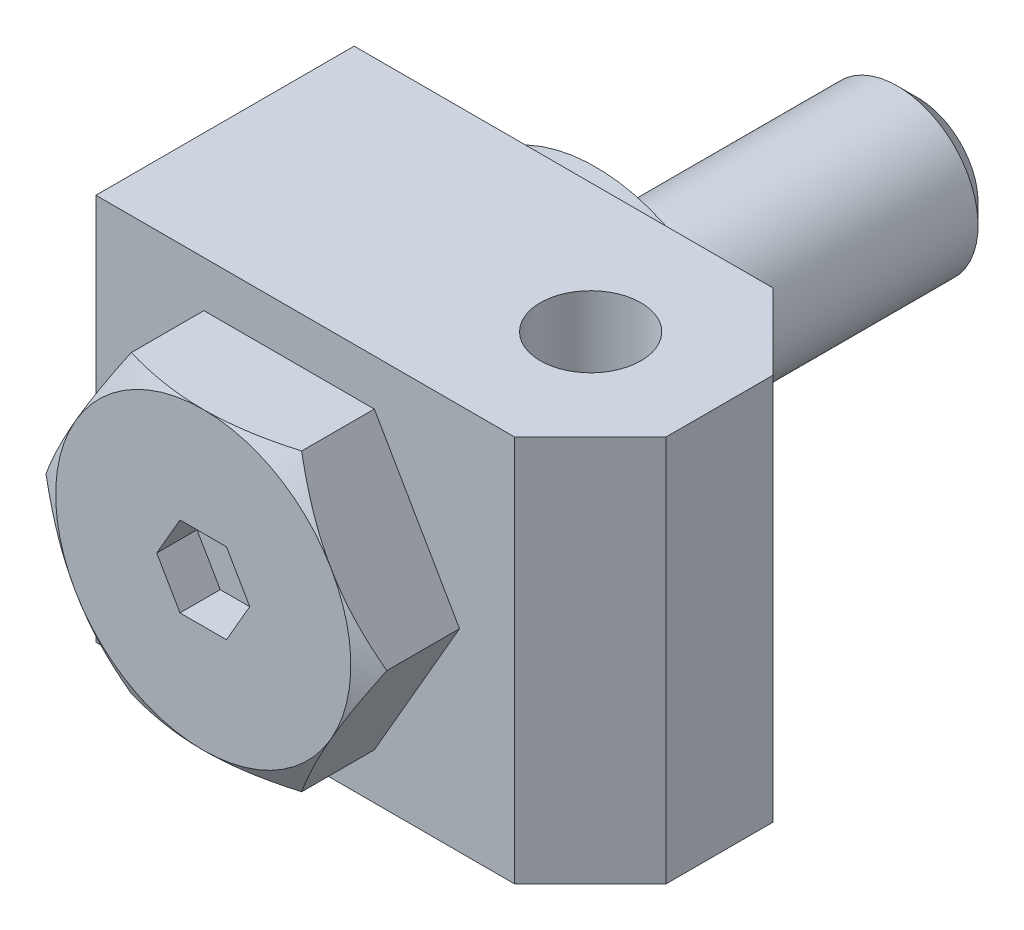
ISO-10303-21;
HEADER;
FILE_DESCRIPTION(('STEP AP214'),'2;1');
FILE_NAME('part.step','',(''),(''),'','','');
FILE_SCHEMA(('AUTOMOTIVE_DESIGN { 1 0 10303 214 1 1 1 1 }'));
ENDSEC;
DATA;
#1=APPLICATION_CONTEXT('core data for automotive mechanical design processes');
#2=APPLICATION_PROTOCOL_DEFINITION('international standard','automotive_design',2000,#1);
#3=PRODUCT_CONTEXT('',#1,'mechanical');
#4=PRODUCT('Part','Part','',(#3));
#5=PRODUCT_RELATED_PRODUCT_CATEGORY('part','',(#4));
#6=PRODUCT_DEFINITION_FORMATION('','',#4);
#7=PRODUCT_DEFINITION_CONTEXT('part definition',#1,'design');
#8=PRODUCT_DEFINITION('design','',#6,#7);
#9=PRODUCT_DEFINITION_SHAPE('','',#8);
#10=(LENGTH_UNIT() NAMED_UNIT(*) SI_UNIT(.MILLI.,.METRE.));
#11=(NAMED_UNIT(*) PLANE_ANGLE_UNIT() SI_UNIT($,.RADIAN.));
#12=(NAMED_UNIT(*) SI_UNIT($,.STERADIAN.) SOLID_ANGLE_UNIT());
#13=UNCERTAINTY_MEASURE_WITH_UNIT(LENGTH_MEASURE(1.E-05),#10,'distance_accuracy_value','');
#14=(GEOMETRIC_REPRESENTATION_CONTEXT(3) GLOBAL_UNCERTAINTY_ASSIGNED_CONTEXT((#13)) GLOBAL_UNIT_ASSIGNED_CONTEXT((#10,
#11,#12)) REPRESENTATION_CONTEXT('',''));
#15=CARTESIAN_POINT('',(0.,0.,0.));
#16=DIRECTION('',(0.,0.,1.));
#17=DIRECTION('',(1.,0.,0.));
#18=AXIS2_PLACEMENT_3D('',#15,#16,#17);
#19=CARTESIAN_POINT('',(0.,0.,-48.4));
#20=DIRECTION('',(0.,0.,1.));
#21=DIRECTION('',(0.,-1.,0.));
#22=AXIS2_PLACEMENT_3D('',#19,#20,#21);
#23=CYLINDRICAL_SURFACE('',#22,12.);
#24=CARTESIAN_POINT('',(0.,0.,-45.));
#25=DIRECTION('',(0.,0.,-1.));
#26=DIRECTION('',(-1.,0.,0.));
#27=AXIS2_PLACEMENT_3D('',#24,#25,#26);
#28=CIRCLE('',#27,12.);
#29=CARTESIAN_POINT('',(-12.,0.,-45.));
#30=VERTEX_POINT('',#29);
#31=EDGE_CURVE('E9',#30,#30,#28,.F.);
#32=ORIENTED_EDGE('',*,*,#31,.T.);
#33=EDGE_LOOP('',(#32));
#34=FACE_BOUND('',#33,.T.);
#35=CARTESIAN_POINT('',(0.,0.,0.));
#36=DIRECTION('',(0.,0.,1.));
#37=DIRECTION('',(0.,-1.,0.));
#38=AXIS2_PLACEMENT_3D('',#35,#36,#37);
#39=CIRCLE('',#38,12.);
#40=CARTESIAN_POINT('',(0.,-12.,0.));
#41=VERTEX_POINT('',#40);
#42=EDGE_CURVE('E374',#41,#41,#39,.F.);
#43=ORIENTED_EDGE('',*,*,#42,.T.);
#44=EDGE_LOOP('',(#43));
#45=FACE_BOUND('',#44,.T.);
#46=ADVANCED_FACE('F14',(#34,#45),#23,.T.);
#47=CARTESIAN_POINT('',(25.4034118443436,0.,-33.0334193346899));
#48=DIRECTION('',(0.866025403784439,0.5,0.));
#49=DIRECTION('',(-0.5,0.866025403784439,0.));
#50=AXIS2_PLACEMENT_3D('',#47,#48,#49);
#51=PLANE('',#50);
#52=DIRECTION('',(0.,0.,1.));
#53=VECTOR('',#52,1.);
#54=CARTESIAN_POINT('',(12.7017059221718,22.,-33.0334193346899));
#55=LINE('',#54,#53);
#56=CARTESIAN_POINT('',(12.7017059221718,22.,45.7));
#57=VERTEX_POINT('',#56);
#58=CARTESIAN_POINT('',(12.7017059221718,22.,56.5350392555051));
#59=VERTEX_POINT('',#58);
#60=EDGE_CURVE('E303',#57,#59,#55,.T.);
#61=ORIENTED_EDGE('',*,*,#60,.T.);
#62=CARTESIAN_POINT('',(12.7015904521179,22.0002,56.5349725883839));
#63=CARTESIAN_POINT('',(12.9807685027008,21.5166494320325,56.6961445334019));
#64=CARTESIAN_POINT('',(13.2610354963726,21.0312127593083,56.8500027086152));
#65=CARTESIAN_POINT('',(13.8238168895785,20.0564467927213,57.141058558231));
#66=CARTESIAN_POINT('',(14.106331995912,19.567116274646,57.2782507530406));
#67=CARTESIAN_POINT('',(14.674161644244,18.583606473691,57.5341332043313));
#68=CARTESIAN_POINT('',(14.9594812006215,18.0894185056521,57.6527792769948));
#69=CARTESIAN_POINT('',(15.5320907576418,17.0976296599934,57.8690135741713));
#70=CARTESIAN_POINT('',(15.8193805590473,16.6000291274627,57.9666038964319));
#71=CARTESIAN_POINT('',(16.3885872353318,15.6141342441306,58.1365841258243));
#72=CARTESIAN_POINT('',(16.6704618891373,15.1259130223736,58.2095361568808));
#73=CARTESIAN_POINT('',(17.2355027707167,14.1472335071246,58.3318601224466));
#74=CARTESIAN_POINT('',(17.518669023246,13.6567751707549,58.3812316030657));
#75=CARTESIAN_POINT('',(18.085477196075,12.6750346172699,58.455147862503));
#76=CARTESIAN_POINT('',(18.3691181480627,12.1837540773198,58.4797221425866));
#77=CARTESIAN_POINT('',(18.9366618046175,11.2007396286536,58.5035155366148));
#78=CARTESIAN_POINT('',(19.2205645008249,10.7090057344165,58.5027354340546));
#79=CARTESIAN_POINT('',(19.7513256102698,9.78970052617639,58.4775909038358));
#80=CARTESIAN_POINT('',(19.9982218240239,9.36206373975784,58.4562926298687));
#81=CARTESIAN_POINT('',(20.491424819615,8.50781109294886,58.3949248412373));
#82=CARTESIAN_POINT('',(20.7377316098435,8.08119521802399,58.3548555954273));
#83=CARTESIAN_POINT('',(21.2296647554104,7.2291420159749,58.2566403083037));
#84=CARTESIAN_POINT('',(21.4752902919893,6.80370610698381,58.1984779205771));
#85=CARTESIAN_POINT('',(21.9653652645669,5.95487135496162,58.0651057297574));
#86=CARTESIAN_POINT('',(22.2098147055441,5.53147250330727,57.9898959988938));
#87=CARTESIAN_POINT('',(22.9519111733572,4.24612371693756,57.7367656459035));
#88=CARTESIAN_POINT('',(23.4474497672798,3.38782569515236,57.5335912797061));
#89=CARTESIAN_POINT('',(24.1852851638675,2.10985730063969,57.1876964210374));
#90=CARTESIAN_POINT('',(24.4301067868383,1.6858138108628,57.0656670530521));
#91=CARTESIAN_POINT('',(24.9180566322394,0.840659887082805,56.8092543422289));
#92=CARTESIAN_POINT('',(25.1611853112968,0.419548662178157,56.6748744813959));
#93=CARTESIAN_POINT('',(25.4035273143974,-0.000200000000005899,56.5349725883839));
#94=B_SPLINE_CURVE_WITH_KNOTS('',3,(#62,#63,#64,#65,#66,#67,#68,#69,#70,#71,#72,#73,#74,#75,#76,
#77,#78,#79,#80,#81,#82,#83,#84,#85,#86,#87,#88,#89,#90,#91,#92,#93),.UNSPECIFIED.,.F.,.F.,(4,2,
2,2,2,2,2,2,2,2,2,2,2,2,2,4),(0.,1.74350234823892,3.48757639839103,5.23574415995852,
6.98373767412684,8.68862327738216,10.393541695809,12.096429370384,13.7992644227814,
15.2816610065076,16.7640363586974,18.2477548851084,19.7314671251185,22.7642468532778,
24.2779950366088,25.7913177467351),.UNSPECIFIED.);
#95=CARTESIAN_POINT('',(19.0525588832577,11.,58.5));
#96=VERTEX_POINT('',#95);
#97=EDGE_CURVE('E304',#59,#96,#94,.T.);
#98=ORIENTED_EDGE('',*,*,#97,.T.);
#99=CARTESIAN_POINT('',(25.4034118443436,0.,56.5350392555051));
#100=VERTEX_POINT('',#99);
#101=EDGE_CURVE('E37',#96,#100,#94,.T.);
#102=ORIENTED_EDGE('',*,*,#101,.T.);
#103=DIRECTION('',(0.,0.,1.));
#104=VECTOR('',#103,1.);
#105=CARTESIAN_POINT('',(25.4034118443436,0.,-33.0334193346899));
#106=LINE('',#105,#104);
#107=CARTESIAN_POINT('',(25.4034118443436,0.,45.7));
#108=VERTEX_POINT('',#107);
#109=EDGE_CURVE('E310',#108,#100,#106,.T.);
#110=ORIENTED_EDGE('',*,*,#109,.F.);
#111=DIRECTION('',(0.5,-0.866025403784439,0.));
#112=VECTOR('',#111,1.);
#113=CARTESIAN_POINT('',(25.4034118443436,0.,45.7));
#114=LINE('',#113,#112);
#115=EDGE_CURVE('E307',#57,#108,#114,.T.);
#116=ORIENTED_EDGE('',*,*,#115,.F.);
#117=EDGE_LOOP('',(#61,#98,#102,#110,#116));
#118=FACE_BOUND('',#117,.T.);
#119=ADVANCED_FACE('F288',(#118),#51,.T.);
#120=CARTESIAN_POINT('',(12.7017059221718,22.,-33.0334193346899));
#121=DIRECTION('',(0.,1.,0.));
#122=DIRECTION('',(-1.,0.,0.));
#123=AXIS2_PLACEMENT_3D('',#120,#121,#122);
#124=PLANE('',#123);
#125=DIRECTION('',(0.,0.,1.));
#126=VECTOR('',#125,1.);
#127=CARTESIAN_POINT('',(-12.7017059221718,22.,-33.0334193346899));
#128=LINE('',#127,#126);
#129=CARTESIAN_POINT('',(-12.7017059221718,22.,45.7));
#130=VERTEX_POINT('',#129);
#131=CARTESIAN_POINT('',(-12.7017059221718,22.,56.5350392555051));
#132=VERTEX_POINT('',#131);
#133=EDGE_CURVE('E309',#130,#132,#128,.T.);
#134=ORIENTED_EDGE('',*,*,#133,.T.);
#135=CARTESIAN_POINT('',(-34.083023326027,22.,47.780543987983));
#136=CARTESIAN_POINT('',(-33.6027553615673,22.,48.013505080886));
#137=CARTESIAN_POINT('',(-33.1219228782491,22.,48.2453018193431));
#138=CARTESIAN_POINT('',(-32.1590110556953,22.,48.7063028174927));
#139=CARTESIAN_POINT('',(-31.676931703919,22.,48.9355070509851));
#140=CARTESIAN_POINT('',(-30.2285177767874,22.,49.618895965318));
#141=CARTESIAN_POINT('',(-29.2601499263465,22.,50.0687875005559));
#142=CARTESIAN_POINT('',(-27.3116352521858,22.,50.9568248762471));
#143=CARTESIAN_POINT('',(-26.3314529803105,22.,51.3948931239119));
#144=CARTESIAN_POINT('',(-24.3632812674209,22.,52.2530628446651));
#145=CARTESIAN_POINT('',(-23.3752921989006,22.,52.6731651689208));
#146=CARTESIAN_POINT('',(-21.3581422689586,22.,53.5037387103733));
#147=CARTESIAN_POINT('',(-20.3286757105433,22.,53.913471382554));
#148=CARTESIAN_POINT('',(-18.2576780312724,22.,54.7018424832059));
#149=CARTESIAN_POINT('',(-17.2161455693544,22.,55.0804774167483));
#150=CARTESIAN_POINT('',(-15.1213542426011,22.,55.796681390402));
#151=CARTESIAN_POINT('',(-14.0681241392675,22.,56.1343338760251));
#152=CARTESIAN_POINT('',(-11.9464557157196,22.,56.757733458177));
#153=CARTESIAN_POINT('',(-10.87802231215,22.,57.0434969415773));
#154=CARTESIAN_POINT('',(-9.26674898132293,22.,57.4220842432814));
#155=CARTESIAN_POINT('',(-8.72969490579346,22.,57.5396841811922));
#156=CARTESIAN_POINT('',(-7.65192372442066,22.,57.7567947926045));
#157=CARTESIAN_POINT('',(-7.11120669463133,22.,57.8563058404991));
#158=CARTESIAN_POINT('',(-6.02649470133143,22.,58.0354783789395));
#159=CARTESIAN_POINT('',(-5.48249984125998,22.,58.1151404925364));
#160=CARTESIAN_POINT('',(-4.39178136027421,22.,58.2530296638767));
#161=CARTESIAN_POINT('',(-3.84505774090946,22.,58.3112567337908));
#162=CARTESIAN_POINT('',(-2.75679839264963,22.,58.404385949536));
#163=CARTESIAN_POINT('',(-2.21528800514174,22.,58.4395824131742));
#164=CARTESIAN_POINT('',(-1.13126532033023,22.,58.4870464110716));
#165=CARTESIAN_POINT('',(-0.58875303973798,22.,58.4993143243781));
#166=CARTESIAN_POINT('',(0.496305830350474,22.,58.5006296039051));
#167=CARTESIAN_POINT('',(1.03885242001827,22.,58.4896768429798));
#168=CARTESIAN_POINT('',(2.1230014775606,22.,58.4448172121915));
#169=CARTESIAN_POINT('',(2.66460390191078,22.,58.4109093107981));
#170=CARTESIAN_POINT('',(3.96733752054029,22.,58.3024590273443));
#171=CARTESIAN_POINT('',(4.72757291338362,22.,58.2169644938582));
#172=CARTESIAN_POINT('',(6.24238249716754,22.,58.0054114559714));
#173=CARTESIAN_POINT('',(6.99695589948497,22.,57.8793474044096));
#174=CARTESIAN_POINT('',(8.49972953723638,22.,57.5911399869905));
#175=CARTESIAN_POINT('',(9.24792429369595,22.,57.4289683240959));
#176=CARTESIAN_POINT('',(10.7367989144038,22.,57.0734927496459));
#177=CARTESIAN_POINT('',(11.4774788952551,22.,56.8801893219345));
#178=CARTESIAN_POINT('',(12.9675415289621,22.,56.4626030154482));
#179=CARTESIAN_POINT('',(13.7167586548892,22.,56.2377335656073));
#180=CARTESIAN_POINT('',(15.2078120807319,22.,55.7648515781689));
#181=CARTESIAN_POINT('',(15.9496483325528,22.,55.5168388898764));
#182=CARTESIAN_POINT('',(17.4263077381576,22.,55.001600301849));
#183=CARTESIAN_POINT('',(18.1611331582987,22.,54.7343808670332));
#184=CARTESIAN_POINT('',(19.6247016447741,22.,54.1838635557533));
#185=CARTESIAN_POINT('',(20.3534447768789,22.,53.9005658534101));
#186=CARTESIAN_POINT('',(22.0503976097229,22.,53.2227558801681));
#187=CARTESIAN_POINT('',(23.0164915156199,22.,52.8229550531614));
#188=CARTESIAN_POINT('',(24.9406295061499,22.,52.0043763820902));
#189=CARTESIAN_POINT('',(25.898673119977,22.,51.5855974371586));
#190=CARTESIAN_POINT('',(27.8081777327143,22.,50.7327971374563));
#191=CARTESIAN_POINT('',(28.7596372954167,22.,50.2987725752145));
#192=CARTESIAN_POINT('',(30.6568492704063,22.,49.4185022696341));
#193=CARTESIAN_POINT('',(31.6026017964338,22.,48.9722567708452));
#194=CARTESIAN_POINT('',(33.4903215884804,22.,48.0693184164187));
#195=CARTESIAN_POINT('',(34.4322838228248,22.,47.6126150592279));
#196=CARTESIAN_POINT('',(36.312171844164,22.,46.6909769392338));
#197=CARTESIAN_POINT('',(37.2500976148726,22.,46.2260421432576));
#198=CARTESIAN_POINT('',(39.1224115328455,22.,45.2893876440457));
#199=CARTESIAN_POINT('',(40.0568000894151,22.,44.8176687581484));
#200=CARTESIAN_POINT('',(41.9226508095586,22.,43.8684883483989));
#201=CARTESIAN_POINT('',(42.8541129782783,22.,43.3910268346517));
#202=CARTESIAN_POINT('',(45.4923194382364,22.,42.0300239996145));
#203=CARTESIAN_POINT('',(47.1961043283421,22.,41.1407460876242));
#204=CARTESIAN_POINT('',(50.5972932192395,22.,39.3499621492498));
#205=CARTESIAN_POINT('',(52.2946970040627,22.,38.4484557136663));
#206=CARTESIAN_POINT('',(55.6803949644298,22.,36.6382408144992));
#207=CARTESIAN_POINT('',(57.3687012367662,22.,35.7295549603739));
#208=CARTESIAN_POINT('',(59.8981387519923,22.,34.3610543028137));
#209=CARTESIAN_POINT('',(60.74075895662,22.,33.9039874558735));
#210=CARTESIAN_POINT('',(62.425104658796,22.,32.9882111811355));
#211=CARTESIAN_POINT('',(63.2668301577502,22.,32.5295017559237));
#212=CARTESIAN_POINT('',(64.1081585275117,22.,32.0700648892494));
#213=B_SPLINE_CURVE_WITH_KNOTS('',3,(#135,#136,#137,#138,#139,#140,#141,#142,#143,#144,#145,
#146,#147,#148,#149,#150,#151,#152,#153,#154,#155,#156,#157,#158,#159,#160,#161,#162,#163,#164,
#165,#166,#167,#168,#169,#170,#171,#172,#173,#174,#175,#176,#177,#178,#179,#180,#181,#182,#183,
#184,#185,#186,#187,#188,#189,#190,#191,#192,#193,#194,#195,#196,#197,#198,#199,#200,#201,#202,
#203,#204,#205,#206,#207,#208,#209,#210,#211,#212),.UNSPECIFIED.,.F.,.F.,(4,2,2,2,2,2,2,2,2,2,2,
2,2,2,2,2,2,2,2,2,2,2,2,2,2,2,2,2,2,2,2,2,2,2,2,2,2,2,4),(0.,1.60135703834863,3.20273024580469,
6.40595234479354,9.62667351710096,12.847241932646,16.1708830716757,19.4948972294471,
22.8120255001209,26.1281043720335,27.7771856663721,29.4262328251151,31.0752282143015,
32.7242226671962,34.351709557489,35.979169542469,37.6066384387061,39.2341804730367,
41.5279930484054,43.8221193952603,46.1180499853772,48.4139448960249,50.7602047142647,
53.1064798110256,55.4519688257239,57.7974324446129,60.9338145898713,64.070378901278,
67.2076071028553,70.3447725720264,73.4852399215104,76.6257199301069,79.7658246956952,
82.9059239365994,88.6715478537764,94.4373651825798,100.189278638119,103.065085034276,
105.940886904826),.UNSPECIFIED.);
#214=CARTESIAN_POINT('',(0.,22.,58.5));
#215=VERTEX_POINT('',#214);
#216=EDGE_CURVE('E276',#132,#215,#213,.T.);
#217=ORIENTED_EDGE('',*,*,#216,.T.);
#218=EDGE_CURVE('E269',#215,#59,#213,.T.);
#219=ORIENTED_EDGE('',*,*,#218,.T.);
#220=ORIENTED_EDGE('',*,*,#60,.F.);
#221=DIRECTION('',(1.,0.,0.));
#222=VECTOR('',#221,1.);
#223=CARTESIAN_POINT('',(12.7017059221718,22.,45.7));
#224=LINE('',#223,#222);
#225=EDGE_CURVE('E326',#130,#57,#224,.T.);
#226=ORIENTED_EDGE('',*,*,#225,.F.);
#227=EDGE_LOOP('',(#134,#217,#219,#220,#226));
#228=FACE_BOUND('',#227,.T.);
#229=ADVANCED_FACE('F284',(#228),#124,.T.);
#230=CARTESIAN_POINT('',(-12.7017059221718,22.,-33.0334193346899));
#231=DIRECTION('',(-0.866025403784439,0.5,0.));
#232=DIRECTION('',(-0.5,-0.866025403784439,0.));
#233=AXIS2_PLACEMENT_3D('',#230,#231,#232);
#234=PLANE('',#233);
#235=DIRECTION('',(0.,0.,1.));
#236=VECTOR('',#235,1.);
#237=CARTESIAN_POINT('',(-25.4034118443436,0.,-33.0334193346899));
#238=LINE('',#237,#236);
#239=CARTESIAN_POINT('',(-25.4034118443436,0.,45.7));
#240=VERTEX_POINT('',#239);
#241=CARTESIAN_POINT('',(-25.4034118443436,0.,56.5350392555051));
#242=VERTEX_POINT('',#241);
#243=EDGE_CURVE('E313',#240,#242,#238,.T.);
#244=ORIENTED_EDGE('',*,*,#243,.T.);
#245=CARTESIAN_POINT('',(-25.4035273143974,-0.0002,56.5349725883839));
#246=CARTESIAN_POINT('',(-25.1243492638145,0.483350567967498,56.6961445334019));
#247=CARTESIAN_POINT('',(-24.8440822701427,0.968787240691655,56.8500027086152));
#248=CARTESIAN_POINT('',(-24.2813008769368,1.94355320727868,57.141058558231));
#249=CARTESIAN_POINT('',(-23.9987857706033,2.43288372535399,57.2782507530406));
#250=CARTESIAN_POINT('',(-23.4309561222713,3.41639352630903,57.5341332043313));
#251=CARTESIAN_POINT('',(-23.1456365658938,3.9105814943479,57.6527792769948));
#252=CARTESIAN_POINT('',(-22.5730270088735,4.90237034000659,57.8690135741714));
#253=CARTESIAN_POINT('',(-22.285737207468,5.39997087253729,57.9666038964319));
#254=CARTESIAN_POINT('',(-21.7165305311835,6.38586575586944,58.1365841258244));
#255=CARTESIAN_POINT('',(-21.434655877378,6.87408697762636,58.2095361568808));
#256=CARTESIAN_POINT('',(-20.8696149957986,7.85276649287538,58.3318601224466));
#257=CARTESIAN_POINT('',(-20.5864487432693,8.34322482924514,58.3812316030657));
#258=CARTESIAN_POINT('',(-20.0196405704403,9.32496538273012,58.455147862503));
#259=CARTESIAN_POINT('',(-19.7359996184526,9.81624592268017,58.4797221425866));
#260=CARTESIAN_POINT('',(-19.1684559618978,10.7992603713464,58.5035155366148));
#261=CARTESIAN_POINT('',(-18.8845532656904,11.2909942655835,58.5027354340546));
#262=CARTESIAN_POINT('',(-18.3537921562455,12.2102994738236,58.4775909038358));
#263=CARTESIAN_POINT('',(-18.1068959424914,12.6379362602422,58.4562926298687));
#264=CARTESIAN_POINT('',(-17.6136929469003,13.4921889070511,58.3949248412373));
#265=CARTESIAN_POINT('',(-17.3673861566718,13.918804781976,58.3548555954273));
#266=CARTESIAN_POINT('',(-16.8754530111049,14.7708579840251,58.2566403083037));
#267=CARTESIAN_POINT('',(-16.629827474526,15.1962938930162,58.1984779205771));
#268=CARTESIAN_POINT('',(-16.1397525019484,16.0451286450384,58.0651057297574));
#269=CARTESIAN_POINT('',(-15.8953030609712,16.4685274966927,57.9898959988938));
#270=CARTESIAN_POINT('',(-15.1532065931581,17.7538762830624,57.7367656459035));
#271=CARTESIAN_POINT('',(-14.6576679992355,18.6121743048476,57.5335912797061));
#272=CARTESIAN_POINT('',(-13.9198326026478,19.8901426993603,57.1876964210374));
#273=CARTESIAN_POINT('',(-13.675010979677,20.3141861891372,57.0656670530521));
#274=CARTESIAN_POINT('',(-13.1870611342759,21.1593401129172,56.8092543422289));
#275=CARTESIAN_POINT('',(-12.9439324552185,21.5804513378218,56.6748744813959));
#276=CARTESIAN_POINT('',(-12.7015904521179,22.0002,56.5349725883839));
#277=B_SPLINE_CURVE_WITH_KNOTS('',3,(#245,#246,#247,#248,#249,#250,#251,#252,#253,#254,#255,
#256,#257,#258,#259,#260,#261,#262,#263,#264,#265,#266,#267,#268,#269,#270,#271,#272,#273,#274,
#275,#276),.UNSPECIFIED.,.F.,.F.,(4,2,2,2,2,2,2,2,2,2,2,2,2,2,2,4),(0.,1.74350234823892,
3.48757639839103,5.23574415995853,6.98373767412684,8.68862327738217,10.393541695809,
12.0964293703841,13.7992644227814,15.2816610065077,16.7640363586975,18.2477548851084,
19.7314671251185,22.7642468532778,24.2779950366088,25.7913177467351),.UNSPECIFIED.);
#278=CARTESIAN_POINT('',(-19.0525588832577,11.,58.5));
#279=VERTEX_POINT('',#278);
#280=EDGE_CURVE('E316',#242,#279,#277,.T.);
#281=ORIENTED_EDGE('',*,*,#280,.T.);
#282=EDGE_CURVE('E277',#279,#132,#277,.T.);
#283=ORIENTED_EDGE('',*,*,#282,.T.);
#284=ORIENTED_EDGE('',*,*,#133,.F.);
#285=DIRECTION('',(0.5,0.866025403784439,0.));
#286=VECTOR('',#285,1.);
#287=CARTESIAN_POINT('',(-12.7017059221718,22.,45.7));
#288=LINE('',#287,#286);
#289=EDGE_CURVE('E411',#240,#130,#288,.T.);
#290=ORIENTED_EDGE('',*,*,#289,.F.);
#291=EDGE_LOOP('',(#244,#281,#283,#284,#290));
#292=FACE_BOUND('',#291,.T.);
#293=ADVANCED_FACE('F287',(#292),#234,.T.);
#294=CARTESIAN_POINT('',(-25.4034118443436,0.,-33.0334193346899));
#295=DIRECTION('',(-0.866025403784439,-0.5,0.));
#296=DIRECTION('',(0.5,-0.866025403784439,0.));
#297=AXIS2_PLACEMENT_3D('',#294,#295,#296);
#298=PLANE('',#297);
#299=DIRECTION('',(0.,0.,1.));
#300=VECTOR('',#299,1.);
#301=CARTESIAN_POINT('',(-12.7017059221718,-22.,-33.0334193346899));
#302=LINE('',#301,#300);
#303=CARTESIAN_POINT('',(-12.7017059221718,-22.,45.7));
#304=VERTEX_POINT('',#303);
#305=CARTESIAN_POINT('',(-12.7017059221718,-22.,56.5350392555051));
#306=VERTEX_POINT('',#305);
#307=EDGE_CURVE('E414',#304,#306,#302,.T.);
#308=ORIENTED_EDGE('',*,*,#307,.T.);
#309=CARTESIAN_POINT('',(-12.7015904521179,-22.0002,56.5349725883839));
#310=CARTESIAN_POINT('',(-12.9807685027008,-21.5166494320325,56.6961445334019));
#311=CARTESIAN_POINT('',(-13.2610354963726,-21.0312127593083,56.8500027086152));
#312=CARTESIAN_POINT('',(-13.8238168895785,-20.0564467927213,57.141058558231));
#313=CARTESIAN_POINT('',(-14.106331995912,-19.567116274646,57.2782507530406));
#314=CARTESIAN_POINT('',(-14.674161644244,-18.583606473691,57.5341332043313));
#315=CARTESIAN_POINT('',(-14.9594812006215,-18.0894185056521,57.6527792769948));
#316=CARTESIAN_POINT('',(-15.5320907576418,-17.0976296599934,57.8690135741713));
#317=CARTESIAN_POINT('',(-15.8193805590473,-16.6000291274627,57.9666038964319));
#318=CARTESIAN_POINT('',(-16.3885872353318,-15.6141342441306,58.1365841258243));
#319=CARTESIAN_POINT('',(-16.6704618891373,-15.1259130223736,58.2095361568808));
#320=CARTESIAN_POINT('',(-17.2355027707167,-14.1472335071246,58.3318601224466));
#321=CARTESIAN_POINT('',(-17.518669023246,-13.6567751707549,58.3812316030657));
#322=CARTESIAN_POINT('',(-18.085477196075,-12.6750346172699,58.455147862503));
#323=CARTESIAN_POINT('',(-18.3691181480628,-12.1837540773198,58.4797221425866));
#324=CARTESIAN_POINT('',(-18.9366618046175,-11.2007396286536,58.5035155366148));
#325=CARTESIAN_POINT('',(-19.2205645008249,-10.7090057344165,58.5027354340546));
#326=CARTESIAN_POINT('',(-19.7513256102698,-9.78970052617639,58.4775909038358));
#327=CARTESIAN_POINT('',(-19.9982218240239,-9.36206373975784,58.4562926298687));
#328=CARTESIAN_POINT('',(-20.4914248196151,-8.50781109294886,58.3949248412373));
#329=CARTESIAN_POINT('',(-20.7377316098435,-8.08119521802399,58.3548555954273));
#330=CARTESIAN_POINT('',(-21.2296647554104,-7.2291420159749,58.2566403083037));
#331=CARTESIAN_POINT('',(-21.4752902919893,-6.80370610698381,58.1984779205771));
#332=CARTESIAN_POINT('',(-21.9653652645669,-5.95487135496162,58.0651057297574));
#333=CARTESIAN_POINT('',(-22.2098147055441,-5.53147250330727,57.9898959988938));
#334=CARTESIAN_POINT('',(-22.9519111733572,-4.24612371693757,57.7367656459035));
#335=CARTESIAN_POINT('',(-23.4474497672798,-3.38782569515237,57.5335912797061));
#336=CARTESIAN_POINT('',(-24.1852851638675,-2.10985730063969,57.1876964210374));
#337=CARTESIAN_POINT('',(-24.4301067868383,-1.68581381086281,57.0656670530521));
#338=CARTESIAN_POINT('',(-24.9180566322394,-0.840659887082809,56.8092543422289));
#339=CARTESIAN_POINT('',(-25.1611853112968,-0.419548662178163,56.6748744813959));
#340=CARTESIAN_POINT('',(-25.4035273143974,0.000199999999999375,56.5349725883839));
#341=B_SPLINE_CURVE_WITH_KNOTS('',3,(#309,#310,#311,#312,#313,#314,#315,#316,#317,#318,#319,
#320,#321,#322,#323,#324,#325,#326,#327,#328,#329,#330,#331,#332,#333,#334,#335,#336,#337,#338,
#339,#340),.UNSPECIFIED.,.F.,.F.,(4,2,2,2,2,2,2,2,2,2,2,2,2,2,2,4),(0.,1.74350234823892,
3.48757639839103,5.23574415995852,6.98373767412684,8.68862327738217,10.393541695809,
12.096429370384,13.7992644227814,15.2816610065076,16.7640363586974,18.2477548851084,
19.7314671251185,22.7642468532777,24.2779950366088,25.7913177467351),.UNSPECIFIED.);
#342=CARTESIAN_POINT('',(-19.0525588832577,-11.,58.5));
#343=VERTEX_POINT('',#342);
#344=EDGE_CURVE('E263',#306,#343,#341,.T.);
#345=ORIENTED_EDGE('',*,*,#344,.T.);
#346=EDGE_CURVE('E397',#343,#242,#341,.T.);
#347=ORIENTED_EDGE('',*,*,#346,.T.);
#348=ORIENTED_EDGE('',*,*,#243,.F.);
#349=DIRECTION('',(-0.5,0.866025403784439,0.));
#350=VECTOR('',#349,1.);
#351=CARTESIAN_POINT('',(-25.4034118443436,0.,45.7));
#352=LINE('',#351,#350);
#353=EDGE_CURVE('E425',#304,#240,#352,.T.);
#354=ORIENTED_EDGE('',*,*,#353,.F.);
#355=EDGE_LOOP('',(#308,#345,#347,#348,#354));
#356=FACE_BOUND('',#355,.T.);
#357=ADVANCED_FACE('F643',(#356),#298,.T.);
#358=CARTESIAN_POINT('',(-12.7017059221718,-22.,-33.0334193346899));
#359=DIRECTION('',(0.,-1.,0.));
#360=DIRECTION('',(0.,0.,-1.));
#361=AXIS2_PLACEMENT_3D('',#358,#359,#360);
#362=PLANE('',#361);
#363=DIRECTION('',(0.,0.,1.));
#364=VECTOR('',#363,1.);
#365=CARTESIAN_POINT('',(12.7017059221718,-22.,-33.0334193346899));
#366=LINE('',#365,#364);
#367=CARTESIAN_POINT('',(12.7017059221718,-22.,45.7));
#368=VERTEX_POINT('',#367);
#369=CARTESIAN_POINT('',(12.7017059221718,-22.,56.5350392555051));
#370=VERTEX_POINT('',#369);
#371=EDGE_CURVE('E322',#368,#370,#366,.T.);
#372=ORIENTED_EDGE('',*,*,#371,.T.);
#373=CARTESIAN_POINT('',(-34.0830233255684,-22.,47.7805439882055));
#374=CARTESIAN_POINT('',(-33.6027553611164,-22.,48.0135050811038));
#375=CARTESIAN_POINT('',(-33.1219228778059,-22.,48.2453018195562));
#376=CARTESIAN_POINT('',(-32.1590110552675,-22.,48.7063028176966));
#377=CARTESIAN_POINT('',(-31.6769317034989,-22.,48.9355070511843));
#378=CARTESIAN_POINT('',(-30.2285177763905,-22.,49.6188959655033));
#379=CARTESIAN_POINT('',(-29.2601499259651,-22.,50.0687875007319));
#380=CARTESIAN_POINT('',(-27.3116352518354,-22.,50.9568248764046));
#381=CARTESIAN_POINT('',(-26.3314529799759,-22.,51.3948931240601));
#382=CARTESIAN_POINT('',(-24.3632812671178,-22.,52.2530628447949));
#383=CARTESIAN_POINT('',(-23.3752921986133,-22.,52.6731651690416));
#384=CARTESIAN_POINT('',(-21.3581422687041,-22.,53.5037387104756));
#385=CARTESIAN_POINT('',(-20.3286757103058,-22.,53.913471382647));
#386=CARTESIAN_POINT('',(-18.2576780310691,-22.,54.7018424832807));
#387=CARTESIAN_POINT('',(-17.2161455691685,-22.,55.0804774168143));
#388=CARTESIAN_POINT('',(-15.12135424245,-22.,55.7966813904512));
#389=CARTESIAN_POINT('',(-14.068124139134,-22.,56.1343338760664));
#390=CARTESIAN_POINT('',(-11.9464557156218,-22.,56.7577334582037));
#391=CARTESIAN_POINT('',(-10.8780223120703,-22.,57.0434969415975));
#392=CARTESIAN_POINT('',(-9.2667489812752,-22.,57.422084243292));
#393=CARTESIAN_POINT('',(-8.72969490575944,-22.,57.5396841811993));
#394=CARTESIAN_POINT('',(-7.65192372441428,-22.,57.7567947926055));
#395=CARTESIAN_POINT('',(-7.11120669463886,-22.,57.8563058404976));
#396=CARTESIAN_POINT('',(-6.02649470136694,-22.,58.0354783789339));
#397=CARTESIAN_POINT('',(-5.48249984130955,-22.,58.1151404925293));
#398=CARTESIAN_POINT('',(-4.39178136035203,-22.,58.2530296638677));
#399=CARTESIAN_POINT('',(-3.84505774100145,-22.,58.3112567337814));
#400=CARTESIAN_POINT('',(-2.75679839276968,-22.,58.4043859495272));
#401=CARTESIAN_POINT('',(-2.21528800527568,-22.,58.4395824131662));
#402=CARTESIAN_POINT('',(-1.13126532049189,-22.,58.4870464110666));
#403=CARTESIAN_POINT('',(-0.588753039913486,-22.,58.4993143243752));
#404=CARTESIAN_POINT('',(0.496305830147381,-22.,58.5006296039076));
#405=CARTESIAN_POINT('',(1.03885241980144,-22.,58.4896768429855));
#406=CARTESIAN_POINT('',(2.12300147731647,-22.,58.4448172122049));
#407=CARTESIAN_POINT('',(2.6646039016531,-22.,58.4109093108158));
#408=CARTESIAN_POINT('',(3.96733752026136,-22.,58.3024590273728));
#409=CARTESIAN_POINT('',(4.72757291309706,-22.,58.2169644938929));
#410=CARTESIAN_POINT('',(6.24238249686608,-22.,58.0054114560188));
#411=CARTESIAN_POINT('',(6.99695589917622,-22.,57.8793474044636));
#412=CARTESIAN_POINT('',(8.49972953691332,-22.,57.5911399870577));
#413=CARTESIAN_POINT('',(9.24792429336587,-22.,57.4289683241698));
#414=CARTESIAN_POINT('',(10.7367989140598,-22.,57.073492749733));
#415=CARTESIAN_POINT('',(11.4774788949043,-22.,56.8801893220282));
#416=CARTESIAN_POINT('',(12.9675415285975,-22.,56.4626030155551));
#417=CARTESIAN_POINT('',(13.7167586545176,-22.,56.2377335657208));
#418=CARTESIAN_POINT('',(15.2078120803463,-22.,55.7648515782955));
#419=CARTESIAN_POINT('',(15.9496483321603,-22.,55.5168388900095));
#420=CARTESIAN_POINT('',(17.4263077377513,-22.,55.0016003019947));
#421=CARTESIAN_POINT('',(18.1611331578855,-22.,54.7343808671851));
#422=CARTESIAN_POINT('',(19.6247016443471,-22.,54.1838635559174));
#423=CARTESIAN_POINT('',(20.3534447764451,-22.,53.9005658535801));
#424=CARTESIAN_POINT('',(22.0503976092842,-22.,53.2227558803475));
#425=CARTESIAN_POINT('',(23.0164915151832,-22.,52.8229550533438));
#426=CARTESIAN_POINT('',(24.9406295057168,-22.,52.0043763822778));
#427=CARTESIAN_POINT('',(25.8986731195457,-22.,51.5855974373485));
#428=CARTESIAN_POINT('',(27.8081777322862,-22.,50.7327971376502));
#429=CARTESIAN_POINT('',(28.7596372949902,-22.,50.2987725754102));
#430=CARTESIAN_POINT('',(30.6568492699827,-22.,49.4185022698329));
#431=CARTESIAN_POINT('',(31.6026017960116,-22.,48.9722567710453));
#432=CARTESIAN_POINT('',(33.4903215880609,-22.,48.0693184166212));
#433=CARTESIAN_POINT('',(34.4322838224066,-22.,47.6126150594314));
#434=CARTESIAN_POINT('',(36.3121718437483,-22.,46.6909769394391));
#435=CARTESIAN_POINT('',(37.2500976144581,-22.,46.2260421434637));
#436=CARTESIAN_POINT('',(39.1224115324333,-22.,45.2893876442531));
#437=CARTESIAN_POINT('',(40.056800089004,-22.,44.8176687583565));
#438=CARTESIAN_POINT('',(41.9226508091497,-22.,43.868488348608));
#439=CARTESIAN_POINT('',(42.8541129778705,-22.,43.3910268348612));
#440=CARTESIAN_POINT('',(45.49231943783,-22.,42.0300239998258));
#441=CARTESIAN_POINT('',(47.1961043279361,-22.,41.1407460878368));
#442=CARTESIAN_POINT('',(50.597293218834,-22.,39.3499621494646));
#443=CARTESIAN_POINT('',(52.2946970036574,-22.,38.448455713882));
#444=CARTESIAN_POINT('',(55.6803949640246,-22.,36.6382408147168));
#445=CARTESIAN_POINT('',(57.3687012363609,-22.,35.7295549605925));
#446=CARTESIAN_POINT('',(59.8981387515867,-22.,34.3610543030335));
#447=CARTESIAN_POINT('',(60.7407589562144,-22.,33.9039874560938));
#448=CARTESIAN_POINT('',(62.4251046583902,-22.,32.9882111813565));
#449=CARTESIAN_POINT('',(63.2668301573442,-22.,32.5295017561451));
#450=CARTESIAN_POINT('',(64.1081585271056,-22.,32.0700648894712));
#451=B_SPLINE_CURVE_WITH_KNOTS('',3,(#373,#374,#375,#376,#377,#378,#379,#380,#381,#382,#383,
#384,#385,#386,#387,#388,#389,#390,#391,#392,#393,#394,#395,#396,#397,#398,#399,#400,#401,#402,
#403,#404,#405,#406,#407,#408,#409,#410,#411,#412,#413,#414,#415,#416,#417,#418,#419,#420,#421,
#422,#423,#424,#425,#426,#427,#428,#429,#430,#431,#432,#433,#434,#435,#436,#437,#438,#439,#440,
#441,#442,#443,#444,#445,#446,#447,#448,#449,#450),.UNSPECIFIED.,.F.,.F.,(4,2,2,2,2,2,2,2,2,2,2,
2,2,2,2,2,2,2,2,2,2,2,2,2,2,2,2,2,2,2,2,2,2,2,2,2,2,2,4),(0.,1.60135703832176,3.20273024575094,
6.40595234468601,9.62667351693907,12.8472419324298,16.1708830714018,19.4948972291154,
22.8120254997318,26.1281043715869,27.777185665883,29.4262328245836,31.0752282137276,
32.72422266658,34.3517095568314,35.97916954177,37.6066384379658,39.234180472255,
41.5279930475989,43.822119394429,46.1180499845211,48.4139448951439,50.7602047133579,
53.1064798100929,55.4519688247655,57.7974324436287,60.933814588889,64.0703789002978,
67.207607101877,70.3447725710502,73.4852399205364,76.6257199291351,79.7658246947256,
82.905923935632,88.6715478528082,94.4373651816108,100.189278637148,103.065085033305,
105.940886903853),.UNSPECIFIED.);
#452=CARTESIAN_POINT('',(0.,-22.,58.5));
#453=VERTEX_POINT('',#452);
#454=EDGE_CURVE('E229',#370,#453,#451,.F.);
#455=ORIENTED_EDGE('',*,*,#454,.T.);
#456=EDGE_CURVE('E429',#453,#306,#451,.F.);
#457=ORIENTED_EDGE('',*,*,#456,.T.);
#458=ORIENTED_EDGE('',*,*,#307,.F.);
#459=DIRECTION('',(-1.,0.,0.));
#460=VECTOR('',#459,1.);
#461=CARTESIAN_POINT('',(-12.7017059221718,-22.,45.7));
#462=LINE('',#461,#460);
#463=EDGE_CURVE('E422',#368,#304,#462,.T.);
#464=ORIENTED_EDGE('',*,*,#463,.F.);
#465=EDGE_LOOP('',(#372,#455,#457,#458,#464));
#466=FACE_BOUND('',#465,.T.);
#467=ADVANCED_FACE('F249',(#466),#362,.T.);
#468=CARTESIAN_POINT('',(12.7017059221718,-22.,-33.0334193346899));
#469=DIRECTION('',(0.866025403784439,-0.5,0.));
#470=DIRECTION('',(0.5,0.866025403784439,0.));
#471=AXIS2_PLACEMENT_3D('',#468,#469,#470);
#472=PLANE('',#471);
#473=ORIENTED_EDGE('',*,*,#109,.T.);
#474=CARTESIAN_POINT('',(25.4035273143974,0.000199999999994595,56.5349725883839));
#475=CARTESIAN_POINT('',(25.1243492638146,-0.48335056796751,56.6961445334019));
#476=CARTESIAN_POINT('',(24.8440822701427,-0.968787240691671,56.8500027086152));
#477=CARTESIAN_POINT('',(24.2813008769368,-1.9435532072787,57.141058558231));
#478=CARTESIAN_POINT('',(23.9987857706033,-2.43288372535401,57.2782507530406));
#479=CARTESIAN_POINT('',(23.4309561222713,-3.41639352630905,57.5341332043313));
#480=CARTESIAN_POINT('',(23.1456365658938,-3.91058149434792,57.6527792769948));
#481=CARTESIAN_POINT('',(22.5730270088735,-4.90237034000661,57.8690135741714));
#482=CARTESIAN_POINT('',(22.285737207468,-5.39997087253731,57.9666038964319));
#483=CARTESIAN_POINT('',(21.7165305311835,-6.38586575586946,58.1365841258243));
#484=CARTESIAN_POINT('',(21.434655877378,-6.87408697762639,58.2095361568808));
#485=CARTESIAN_POINT('',(20.8696149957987,-7.8527664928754,58.3318601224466));
#486=CARTESIAN_POINT('',(20.5864487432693,-8.34322482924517,58.3812316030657));
#487=CARTESIAN_POINT('',(20.0196405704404,-9.32496538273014,58.455147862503));
#488=CARTESIAN_POINT('',(19.7359996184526,-9.81624592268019,58.4797221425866));
#489=CARTESIAN_POINT('',(19.1684559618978,-10.7992603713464,58.5035155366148));
#490=CARTESIAN_POINT('',(18.8845532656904,-11.2909942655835,58.5027354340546));
#491=CARTESIAN_POINT('',(18.3537921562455,-12.2102994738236,58.4775909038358));
#492=CARTESIAN_POINT('',(18.1068959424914,-12.6379362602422,58.4562926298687));
#493=CARTESIAN_POINT('',(17.6136929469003,-13.4921889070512,58.3949248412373));
#494=CARTESIAN_POINT('',(17.3673861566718,-13.918804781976,58.3548555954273));
#495=CARTESIAN_POINT('',(16.8754530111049,-14.7708579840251,58.2566403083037));
#496=CARTESIAN_POINT('',(16.629827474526,-15.1962938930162,58.1984779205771));
#497=CARTESIAN_POINT('',(16.1397525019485,-16.0451286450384,58.0651057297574));
#498=CARTESIAN_POINT('',(15.8953030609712,-16.4685274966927,57.9898959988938));
#499=CARTESIAN_POINT('',(15.1532065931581,-17.7538762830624,57.7367656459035));
#500=CARTESIAN_POINT('',(14.6576679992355,-18.6121743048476,57.5335912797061));
#501=CARTESIAN_POINT('',(13.9198326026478,-19.8901426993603,57.1876964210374));
#502=CARTESIAN_POINT('',(13.675010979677,-20.3141861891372,57.0656670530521));
#503=CARTESIAN_POINT('',(13.187061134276,-21.1593401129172,56.8092543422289));
#504=CARTESIAN_POINT('',(12.9439324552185,-21.5804513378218,56.6748744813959));
#505=CARTESIAN_POINT('',(12.7015904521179,-22.0002,56.5349725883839));
#506=B_SPLINE_CURVE_WITH_KNOTS('',3,(#474,#475,#476,#477,#478,#479,#480,#481,#482,#483,#484,
#485,#486,#487,#488,#489,#490,#491,#492,#493,#494,#495,#496,#497,#498,#499,#500,#501,#502,#503,
#504,#505),.UNSPECIFIED.,.F.,.F.,(4,2,2,2,2,2,2,2,2,2,2,2,2,2,2,4),(0.,1.74350234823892,
3.48757639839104,5.23574415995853,6.98373767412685,8.68862327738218,10.393541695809,
12.0964293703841,13.7992644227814,15.2816610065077,16.7640363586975,18.2477548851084,
19.7314671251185,22.7642468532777,24.2779950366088,25.7913177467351),.UNSPECIFIED.);
#507=CARTESIAN_POINT('',(19.0525588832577,-11.,58.5));
#508=VERTEX_POINT('',#507);
#509=EDGE_CURVE('E228',#100,#508,#506,.T.);
#510=ORIENTED_EDGE('',*,*,#509,.T.);
#511=EDGE_CURVE('E219',#508,#370,#506,.T.);
#512=ORIENTED_EDGE('',*,*,#511,.T.);
#513=ORIENTED_EDGE('',*,*,#371,.F.);
#514=DIRECTION('',(-0.5,-0.866025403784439,0.));
#515=VECTOR('',#514,1.);
#516=CARTESIAN_POINT('',(12.7017059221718,-22.,45.7));
#517=LINE('',#516,#515);
#518=EDGE_CURVE('E321',#108,#368,#517,.T.);
#519=ORIENTED_EDGE('',*,*,#518,.F.);
#520=EDGE_LOOP('',(#473,#510,#512,#513,#519));
#521=FACE_BOUND('',#520,.T.);
#522=ADVANCED_FACE('F236',(#521),#472,.T.);
#523=CARTESIAN_POINT('',(44.9,28.85,45.7));
#524=DIRECTION('',(0.,-1.,0.));
#525=DIRECTION('',(1.,0.,0.));
#526=AXIS2_PLACEMENT_3D('',#523,#524,#525);
#527=PLANE('',#526);
#528=CARTESIAN_POINT('',(25.7,28.85,26.45));
#529=DIRECTION('',(0.,-1.,0.));
#530=DIRECTION('',(1.,0.,0.));
#531=AXIS2_PLACEMENT_3D('',#528,#529,#530);
#532=CIRCLE('',#531,7.5);
#533=CARTESIAN_POINT('',(33.2,28.85,26.45));
#534=VERTEX_POINT('',#533);
#535=EDGE_CURVE('E197',#534,#534,#532,.T.);
#536=ORIENTED_EDGE('',*,*,#535,.T.);
#537=EDGE_LOOP('',(#536));
#538=FACE_BOUND('',#537,.T.);
#539=DIRECTION('',(0.,0.,-1.));
#540=VECTOR('',#539,1.);
#541=CARTESIAN_POINT('',(-28.8,28.85,45.7));
#542=LINE('',#541,#540);
#543=CARTESIAN_POINT('',(-28.8,28.85,45.7));
#544=VERTEX_POINT('',#543);
#545=CARTESIAN_POINT('',(-28.8,28.85,7.2));
#546=VERTEX_POINT('',#545);
#547=EDGE_CURVE('E345',#544,#546,#542,.T.);
#548=ORIENTED_EDGE('',*,*,#547,.F.);
#549=DIRECTION('',(-1.,0.,0.));
#550=VECTOR('',#549,1.);
#551=CARTESIAN_POINT('',(44.9,28.85,45.7));
#552=LINE('',#551,#550);
#553=CARTESIAN_POINT('',(33.6,28.85,45.7));
#554=VERTEX_POINT('',#553);
#555=EDGE_CURVE('E330',#554,#544,#552,.T.);
#556=ORIENTED_EDGE('',*,*,#555,.F.);
#557=DIRECTION('',(0.707106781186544,0.,-0.707106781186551));
#558=VECTOR('',#557,1.);
#559=CARTESIAN_POINT('',(33.6,28.85,45.7));
#560=LINE('',#559,#558);
#561=CARTESIAN_POINT('',(44.9,28.85,34.4));
#562=VERTEX_POINT('',#561);
#563=EDGE_CURVE('E359',#554,#562,#560,.T.);
#564=ORIENTED_EDGE('',*,*,#563,.T.);
#565=DIRECTION('',(0.,0.,-1.));
#566=VECTOR('',#565,1.);
#567=CARTESIAN_POINT('',(44.9,28.85,45.7));
#568=LINE('',#567,#566);
#569=CARTESIAN_POINT('',(44.9,28.85,18.5));
#570=VERTEX_POINT('',#569);
#571=EDGE_CURVE('E336',#562,#570,#568,.T.);
#572=ORIENTED_EDGE('',*,*,#571,.T.);
#573=DIRECTION('',(0.707106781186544,0.,0.707106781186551));
#574=VECTOR('',#573,1.);
#575=CARTESIAN_POINT('',(44.9,28.85,18.5));
#576=LINE('',#575,#574);
#577=CARTESIAN_POINT('',(33.6,28.85,7.2));
#578=VERTEX_POINT('',#577);
#579=EDGE_CURVE('E357',#570,#578,#576,.F.);
#580=ORIENTED_EDGE('',*,*,#579,.T.);
#581=DIRECTION('',(-1.,0.,0.));
#582=VECTOR('',#581,1.);
#583=CARTESIAN_POINT('',(44.9,28.85,7.2));
#584=LINE('',#583,#582);
#585=EDGE_CURVE('E323',#578,#546,#584,.T.);
#586=ORIENTED_EDGE('',*,*,#585,.T.);
#587=EDGE_LOOP('',(#548,#556,#564,#572,#580,#586));
#588=FACE_BOUND('',#587,.T.);
#589=ADVANCED_FACE('F489',(#538,#588),#527,.F.);
#590=CARTESIAN_POINT('',(44.9,-28.85,45.7));
#591=DIRECTION('',(0.,1.,0.));
#592=DIRECTION('',(-1.,0.,0.));
#593=AXIS2_PLACEMENT_3D('',#590,#591,#592);
#594=PLANE('',#593);
#595=CARTESIAN_POINT('',(25.7,-28.85,26.45));
#596=DIRECTION('',(0.,-1.,0.));
#597=DIRECTION('',(1.,0.,0.));
#598=AXIS2_PLACEMENT_3D('',#595,#596,#597);
#599=CIRCLE('',#598,7.5);
#600=CARTESIAN_POINT('',(33.2,-28.85,26.45));
#601=VERTEX_POINT('',#600);
#602=EDGE_CURVE('E185',#601,#601,#599,.T.);
#603=ORIENTED_EDGE('',*,*,#602,.F.);
#604=EDGE_LOOP('',(#603));
#605=FACE_BOUND('',#604,.T.);
#606=DIRECTION('',(1.,0.,0.));
#607=VECTOR('',#606,1.);
#608=CARTESIAN_POINT('',(44.9,-28.85,7.2));
#609=LINE('',#608,#607);
#610=CARTESIAN_POINT('',(-28.8,-28.85,7.2));
#611=VERTEX_POINT('',#610);
#612=CARTESIAN_POINT('',(33.6,-28.85,7.2));
#613=VERTEX_POINT('',#612);
#614=EDGE_CURVE('E328',#611,#613,#609,.T.);
#615=ORIENTED_EDGE('',*,*,#614,.T.);
#616=DIRECTION('',(-0.707106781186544,0.,-0.707106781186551));
#617=VECTOR('',#616,1.);
#618=CARTESIAN_POINT('',(44.9,-28.85,18.5));
#619=LINE('',#618,#617);
#620=CARTESIAN_POINT('',(44.9,-28.85,18.5));
#621=VERTEX_POINT('',#620);
#622=EDGE_CURVE('E366',#613,#621,#619,.F.);
#623=ORIENTED_EDGE('',*,*,#622,.T.);
#624=DIRECTION('',(0.,0.,-1.));
#625=VECTOR('',#624,1.);
#626=CARTESIAN_POINT('',(44.9,-28.85,45.7));
#627=LINE('',#626,#625);
#628=CARTESIAN_POINT('',(44.9,-28.85,34.4));
#629=VERTEX_POINT('',#628);
#630=EDGE_CURVE('E339',#629,#621,#627,.T.);
#631=ORIENTED_EDGE('',*,*,#630,.F.);
#632=DIRECTION('',(-0.707106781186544,0.,0.707106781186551));
#633=VECTOR('',#632,1.);
#634=CARTESIAN_POINT('',(33.6,-28.85,45.7));
#635=LINE('',#634,#633);
#636=CARTESIAN_POINT('',(33.6,-28.85,45.7));
#637=VERTEX_POINT('',#636);
#638=EDGE_CURVE('E368',#629,#637,#635,.T.);
#639=ORIENTED_EDGE('',*,*,#638,.T.);
#640=DIRECTION('',(1.,0.,0.));
#641=VECTOR('',#640,1.);
#642=CARTESIAN_POINT('',(44.9,-28.85,45.7));
#643=LINE('',#642,#641);
#644=CARTESIAN_POINT('',(-28.8,-28.85,45.7));
#645=VERTEX_POINT('',#644);
#646=EDGE_CURVE('E334',#645,#637,#643,.T.);
#647=ORIENTED_EDGE('',*,*,#646,.F.);
#648=DIRECTION('',(0.,0.,-1.));
#649=VECTOR('',#648,1.);
#650=CARTESIAN_POINT('',(-28.8,-28.85,45.7));
#651=LINE('',#650,#649);
#652=EDGE_CURVE('E342',#645,#611,#651,.T.);
#653=ORIENTED_EDGE('',*,*,#652,.T.);
#654=EDGE_LOOP('',(#615,#623,#631,#639,#647,#653));
#655=FACE_BOUND('',#654,.T.);
#656=ADVANCED_FACE('F486',(#605,#655),#594,.F.);
#657=CARTESIAN_POINT('',(0.,0.,0.));
#658=DIRECTION('',(0.,0.,1.));
#659=DIRECTION('',(0.,-1.,0.));
#660=AXIS2_PLACEMENT_3D('',#657,#658,#659);
#661=PLANE('',#660);
#662=CARTESIAN_POINT('',(0.,0.,0.));
#663=DIRECTION('',(0.,0.,1.));
#664=DIRECTION('',(0.,-1.,0.));
#665=AXIS2_PLACEMENT_3D('',#662,#663,#664);
#666=CIRCLE('',#665,24.05);
#667=CARTESIAN_POINT('',(0.,-24.05,0.));
#668=VERTEX_POINT('',#667);
#669=EDGE_CURVE('E348',#668,#668,#666,.T.);
#670=ORIENTED_EDGE('',*,*,#669,.F.);
#671=EDGE_LOOP('',(#670));
#672=FACE_BOUND('',#671,.T.);
#673=ORIENTED_EDGE('',*,*,#42,.F.);
#674=EDGE_LOOP('',(#673));
#675=FACE_BOUND('',#674,.T.);
#676=ADVANCED_FACE('F481',(#672,#675),#661,.F.);
#677=CARTESIAN_POINT('',(-28.8,28.85,45.7));
#678=DIRECTION('',(0.,0.,1.));
#679=DIRECTION('',(0.,-1.,0.));
#680=AXIS2_PLACEMENT_3D('',#677,#678,#679);
#681=PLANE('',#680);
#682=ORIENTED_EDGE('',*,*,#646,.T.);
#683=DIRECTION('',(0.,1.,0.));
#684=VECTOR('',#683,1.);
#685=CARTESIAN_POINT('',(33.6,28.85,45.7));
#686=LINE('',#685,#684);
#687=EDGE_CURVE('E354',#637,#554,#686,.T.);
#688=ORIENTED_EDGE('',*,*,#687,.T.);
#689=ORIENTED_EDGE('',*,*,#555,.T.);
#690=DIRECTION('',(0.,-1.,0.));
#691=VECTOR('',#690,1.);
#692=CARTESIAN_POINT('',(-28.8,28.85,45.7));
#693=LINE('',#692,#691);
#694=EDGE_CURVE('E332',#544,#645,#693,.T.);
#695=ORIENTED_EDGE('',*,*,#694,.T.);
#696=EDGE_LOOP('',(#682,#688,#689,#695));
#697=FACE_BOUND('',#696,.T.);
#698=ORIENTED_EDGE('',*,*,#115,.T.);
#699=ORIENTED_EDGE('',*,*,#518,.T.);
#700=ORIENTED_EDGE('',*,*,#463,.T.);
#701=ORIENTED_EDGE('',*,*,#353,.T.);
#702=ORIENTED_EDGE('',*,*,#289,.T.);
#703=ORIENTED_EDGE('',*,*,#225,.T.);
#704=EDGE_LOOP('',(#698,#699,#700,#701,#702,#703));
#705=FACE_BOUND('',#704,.T.);
#706=ADVANCED_FACE('F428',(#697,#705),#681,.T.);
#707=CARTESIAN_POINT('',(0.,0.,7.2));
#708=DIRECTION('',(0.,0.,-1.));
#709=DIRECTION('',(0.,1.,0.));
#710=AXIS2_PLACEMENT_3D('',#707,#708,#709);
#711=CYLINDRICAL_SURFACE('',#710,24.05);
#712=CARTESIAN_POINT('',(0.,0.,7.2));
#713=DIRECTION('',(0.,0.,1.));
#714=DIRECTION('',(0.,-1.,0.));
#715=AXIS2_PLACEMENT_3D('',#712,#713,#714);
#716=CIRCLE('',#715,24.05);
#717=CARTESIAN_POINT('',(0.,-24.05,7.2));
#718=VERTEX_POINT('',#717);
#719=EDGE_CURVE('E351',#718,#718,#716,.T.);
#720=ORIENTED_EDGE('',*,*,#719,.F.);
#721=EDGE_LOOP('',(#720));
#722=FACE_BOUND('',#721,.T.);
#723=ORIENTED_EDGE('',*,*,#669,.T.);
#724=EDGE_LOOP('',(#723));
#725=FACE_BOUND('',#724,.T.);
#726=ADVANCED_FACE('F477',(#722,#725),#711,.T.);
#727=CARTESIAN_POINT('',(-28.8,28.85,7.2));
#728=DIRECTION('',(0.,0.,1.));
#729=DIRECTION('',(0.,-1.,0.));
#730=AXIS2_PLACEMENT_3D('',#727,#728,#729);
#731=PLANE('',#730);
#732=ORIENTED_EDGE('',*,*,#585,.F.);
#733=DIRECTION('',(0.,-1.,0.));
#734=VECTOR('',#733,1.);
#735=CARTESIAN_POINT('',(33.6,28.85,7.2));
#736=LINE('',#735,#734);
#737=EDGE_CURVE('E371',#578,#613,#736,.T.);
#738=ORIENTED_EDGE('',*,*,#737,.T.);
#739=ORIENTED_EDGE('',*,*,#614,.F.);
#740=DIRECTION('',(0.,-1.,0.));
#741=VECTOR('',#740,1.);
#742=CARTESIAN_POINT('',(-28.8,28.85,7.2));
#743=LINE('',#742,#741);
#744=EDGE_CURVE('E325',#546,#611,#743,.T.);
#745=ORIENTED_EDGE('',*,*,#744,.F.);
#746=EDGE_LOOP('',(#732,#738,#739,#745));
#747=FACE_BOUND('',#746,.T.);
#748=ORIENTED_EDGE('',*,*,#719,.T.);
#749=EDGE_LOOP('',(#748));
#750=FACE_BOUND('',#749,.T.);
#751=ADVANCED_FACE('F473',(#747,#750),#731,.F.);
#752=CARTESIAN_POINT('',(-28.8,28.85,45.7));
#753=DIRECTION('',(1.,0.,0.));
#754=DIRECTION('',(0.,0.,1.));
#755=AXIS2_PLACEMENT_3D('',#752,#753,#754);
#756=PLANE('',#755);
#757=ORIENTED_EDGE('',*,*,#744,.T.);
#758=ORIENTED_EDGE('',*,*,#652,.F.);
#759=ORIENTED_EDGE('',*,*,#694,.F.);
#760=ORIENTED_EDGE('',*,*,#547,.T.);
#761=EDGE_LOOP('',(#757,#758,#759,#760));
#762=FACE_BOUND('',#761,.T.);
#763=ADVANCED_FACE('F476',(#762),#756,.F.);
#764=CARTESIAN_POINT('',(44.9,28.85,45.7));
#765=DIRECTION('',(-1.,0.,0.));
#766=DIRECTION('',(0.,0.,-1.));
#767=AXIS2_PLACEMENT_3D('',#764,#765,#766);
#768=PLANE('',#767);
#769=ORIENTED_EDGE('',*,*,#571,.F.);
#770=DIRECTION('',(0.,-1.,0.));
#771=VECTOR('',#770,1.);
#772=CARTESIAN_POINT('',(44.9,-28.85,34.4));
#773=LINE('',#772,#771);
#774=EDGE_CURVE('E364',#562,#629,#773,.T.);
#775=ORIENTED_EDGE('',*,*,#774,.T.);
#776=ORIENTED_EDGE('',*,*,#630,.T.);
#777=DIRECTION('',(0.,1.,0.));
#778=VECTOR('',#777,1.);
#779=CARTESIAN_POINT('',(44.9,28.85,18.5));
#780=LINE('',#779,#778);
#781=EDGE_CURVE('E361',#621,#570,#780,.T.);
#782=ORIENTED_EDGE('',*,*,#781,.T.);
#783=EDGE_LOOP('',(#769,#775,#776,#782));
#784=FACE_BOUND('',#783,.T.);
#785=ADVANCED_FACE('F465',(#784),#768,.F.);
#786=CARTESIAN_POINT('',(33.6,28.85,45.7));
#787=DIRECTION('',(0.707106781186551,0.,0.707106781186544));
#788=DIRECTION('',(-0.707106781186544,0.,0.707106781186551));
#789=AXIS2_PLACEMENT_3D('',#786,#787,#788);
#790=PLANE('',#789);
#791=ORIENTED_EDGE('',*,*,#638,.F.);
#792=ORIENTED_EDGE('',*,*,#774,.F.);
#793=ORIENTED_EDGE('',*,*,#563,.F.);
#794=ORIENTED_EDGE('',*,*,#687,.F.);
#795=EDGE_LOOP('',(#791,#792,#793,#794));
#796=FACE_BOUND('',#795,.T.);
#797=ADVANCED_FACE('F458',(#796),#790,.T.);
#798=CARTESIAN_POINT('',(44.9,28.85,18.5));
#799=DIRECTION('',(-0.707106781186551,0.,0.707106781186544));
#800=DIRECTION('',(-0.707106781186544,0.,-0.707106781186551));
#801=AXIS2_PLACEMENT_3D('',#798,#799,#800);
#802=PLANE('',#801);
#803=ORIENTED_EDGE('',*,*,#622,.F.);
#804=ORIENTED_EDGE('',*,*,#737,.F.);
#805=ORIENTED_EDGE('',*,*,#579,.F.);
#806=ORIENTED_EDGE('',*,*,#781,.F.);
#807=EDGE_LOOP('',(#803,#804,#805,#806));
#808=FACE_BOUND('',#807,.T.);
#809=ADVANCED_FACE('F453',(#808),#802,.F.);
#810=CARTESIAN_POINT('',(0.,0.,58.5));
#811=DIRECTION('',(0.,0.,-1.));
#812=DIRECTION('',(0.,1.,0.));
#813=AXIS2_PLACEMENT_3D('',#810,#811,#812);
#814=CONICAL_SURFACE('',#813,22.,1.0471975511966);
#815=CARTESIAN_POINT('',(0.,0.,58.5));
#816=DIRECTION('',(0.,0.,-1.));
#817=DIRECTION('',(0.,1.,0.));
#818=AXIS2_PLACEMENT_3D('',#815,#816,#817);
#819=CIRCLE('',#818,22.);
#820=EDGE_CURVE('E377',#279,#215,#819,.T.);
#821=ORIENTED_EDGE('',*,*,#820,.T.);
#822=ORIENTED_EDGE('',*,*,#216,.F.);
#823=ORIENTED_EDGE('',*,*,#282,.F.);
#824=EDGE_LOOP('',(#821,#822,#823));
#825=FACE_BOUND('',#824,.T.);
#826=ADVANCED_FACE('F403',(#825),#814,.T.);
#827=ORIENTED_EDGE('',*,*,#346,.F.);
#828=EDGE_CURVE('E379',#343,#279,#819,.T.);
#829=ORIENTED_EDGE('',*,*,#828,.T.);
#830=ORIENTED_EDGE('',*,*,#280,.F.);
#831=EDGE_LOOP('',(#827,#829,#830));
#832=FACE_BOUND('',#831,.T.);
#833=ADVANCED_FACE('F247',(#832),#814,.T.);
#834=ORIENTED_EDGE('',*,*,#456,.F.);
#835=EDGE_CURVE('E388',#453,#343,#819,.T.);
#836=ORIENTED_EDGE('',*,*,#835,.T.);
#837=ORIENTED_EDGE('',*,*,#344,.F.);
#838=EDGE_LOOP('',(#834,#836,#837));
#839=FACE_BOUND('',#838,.T.);
#840=ADVANCED_FACE('F245',(#839),#814,.T.);
#841=ORIENTED_EDGE('',*,*,#511,.F.);
#842=CARTESIAN_POINT('',(0.,0.,58.5));
#843=DIRECTION('',(0.,0.,1.));
#844=DIRECTION('',(0.,-1.,0.));
#845=AXIS2_PLACEMENT_3D('',#842,#843,#844);
#846=CIRCLE('',#845,22.);
#847=EDGE_CURVE('E209',#453,#508,#846,.T.);
#848=ORIENTED_EDGE('',*,*,#847,.F.);
#849=ORIENTED_EDGE('',*,*,#454,.F.);
#850=EDGE_LOOP('',(#841,#848,#849));
#851=FACE_BOUND('',#850,.T.);
#852=ADVANCED_FACE('F240',(#851),#814,.T.);
#853=EDGE_CURVE('E384',#96,#508,#819,.T.);
#854=ORIENTED_EDGE('',*,*,#853,.T.);
#855=ORIENTED_EDGE('',*,*,#509,.F.);
#856=ORIENTED_EDGE('',*,*,#101,.F.);
#857=EDGE_LOOP('',(#854,#855,#856));
#858=FACE_BOUND('',#857,.T.);
#859=ADVANCED_FACE('F244',(#858),#814,.T.);
#860=EDGE_CURVE('E380',#215,#96,#819,.T.);
#861=ORIENTED_EDGE('',*,*,#860,.T.);
#862=ORIENTED_EDGE('',*,*,#97,.F.);
#863=ORIENTED_EDGE('',*,*,#218,.F.);
#864=EDGE_LOOP('',(#861,#862,#863));
#865=FACE_BOUND('',#864,.T.);
#866=ADVANCED_FACE('F438',(#865),#814,.T.);
#867=CARTESIAN_POINT('',(-12.8171759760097,22.2,58.5));
#868=DIRECTION('',(0.,0.,-1.));
#869=DIRECTION('',(0.,1.,0.));
#870=AXIS2_PLACEMENT_3D('',#867,#868,#869);
#871=PLANE('',#870);
#872=DIRECTION('',(0.5,-0.866025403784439,0.));
#873=VECTOR('',#872,1.);
#874=CARTESIAN_POINT('',(-6.92820323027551,0.,58.5));
#875=LINE('',#874,#873);
#876=CARTESIAN_POINT('',(-6.92820323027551,0.,58.5));
#877=VERTEX_POINT('',#876);
#878=CARTESIAN_POINT('',(-3.46410161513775,-6.,58.5));
#879=VERTEX_POINT('',#878);
#880=EDGE_CURVE('E196',#877,#879,#875,.T.);
#881=ORIENTED_EDGE('',*,*,#880,.F.);
#882=DIRECTION('',(-0.5,-0.866025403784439,0.));
#883=VECTOR('',#882,1.);
#884=CARTESIAN_POINT('',(-3.46410161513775,6.,58.5));
#885=LINE('',#884,#883);
#886=CARTESIAN_POINT('',(-3.46410161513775,6.,58.5));
#887=VERTEX_POINT('',#886);
#888=EDGE_CURVE('E29',#887,#877,#885,.T.);
#889=ORIENTED_EDGE('',*,*,#888,.F.);
#890=DIRECTION('',(-1.,0.,0.));
#891=VECTOR('',#890,1.);
#892=CARTESIAN_POINT('',(3.46410161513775,6.,58.5));
#893=LINE('',#892,#891);
#894=CARTESIAN_POINT('',(3.46410161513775,6.,58.5));
#895=VERTEX_POINT('',#894);
#896=EDGE_CURVE('E179',#895,#887,#893,.T.);
#897=ORIENTED_EDGE('',*,*,#896,.F.);
#898=DIRECTION('',(-0.5,0.866025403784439,0.));
#899=VECTOR('',#898,1.);
#900=CARTESIAN_POINT('',(6.92820323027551,0.,58.5));
#901=LINE('',#900,#899);
#902=CARTESIAN_POINT('',(6.92820323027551,0.,58.5));
#903=VERTEX_POINT('',#902);
#904=EDGE_CURVE('E182',#903,#895,#901,.T.);
#905=ORIENTED_EDGE('',*,*,#904,.F.);
#906=DIRECTION('',(0.5,0.866025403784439,0.));
#907=VECTOR('',#906,1.);
#908=CARTESIAN_POINT('',(3.46410161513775,-6.,58.5));
#909=LINE('',#908,#907);
#910=CARTESIAN_POINT('',(3.46410161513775,-6.,58.5));
#911=VERTEX_POINT('',#910);
#912=EDGE_CURVE('E202',#911,#903,#909,.T.);
#913=ORIENTED_EDGE('',*,*,#912,.F.);
#914=DIRECTION('',(1.,0.,0.));
#915=VECTOR('',#914,1.);
#916=CARTESIAN_POINT('',(-3.46410161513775,-6.,58.5));
#917=LINE('',#916,#915);
#918=EDGE_CURVE('E199',#879,#911,#917,.T.);
#919=ORIENTED_EDGE('',*,*,#918,.F.);
#920=EDGE_LOOP('',(#881,#889,#897,#905,#913,#919));
#921=FACE_BOUND('',#920,.T.);
#922=ORIENTED_EDGE('',*,*,#860,.F.);
#923=ORIENTED_EDGE('',*,*,#820,.F.);
#924=ORIENTED_EDGE('',*,*,#828,.F.);
#925=ORIENTED_EDGE('',*,*,#835,.F.);
#926=ORIENTED_EDGE('',*,*,#847,.T.);
#927=ORIENTED_EDGE('',*,*,#853,.F.);
#928=EDGE_LOOP('',(#922,#923,#924,#925,#926,#927));
#929=FACE_BOUND('',#928,.T.);
#930=ADVANCED_FACE('F407',(#921,#929),#871,.F.);
#931=CARTESIAN_POINT('',(-3.46410161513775,6.,52.5));
#932=DIRECTION('',(-0.866025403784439,0.5,0.));
#933=DIRECTION('',(-0.5,-0.866025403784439,0.));
#934=AXIS2_PLACEMENT_3D('',#931,#932,#933);
#935=PLANE('',#934);
#936=ORIENTED_EDGE('',*,*,#888,.T.);
#937=DIRECTION('',(0.,0.,1.));
#938=VECTOR('',#937,1.);
#939=CARTESIAN_POINT('',(-6.92820323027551,0.,52.5));
#940=LINE('',#939,#938);
#941=CARTESIAN_POINT('',(-6.92820323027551,0.,52.5));
#942=VERTEX_POINT('',#941);
#943=EDGE_CURVE('E156',#942,#877,#940,.T.);
#944=ORIENTED_EDGE('',*,*,#943,.F.);
#945=DIRECTION('',(-0.5,-0.866025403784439,0.));
#946=VECTOR('',#945,1.);
#947=CARTESIAN_POINT('',(-3.46410161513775,6.,52.5));
#948=LINE('',#947,#946);
#949=CARTESIAN_POINT('',(-3.46410161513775,6.,52.5));
#950=VERTEX_POINT('',#949);
#951=EDGE_CURVE('E160',#950,#942,#948,.T.);
#952=ORIENTED_EDGE('',*,*,#951,.F.);
#953=DIRECTION('',(0.,0.,1.));
#954=VECTOR('',#953,1.);
#955=CARTESIAN_POINT('',(-3.46410161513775,6.,52.5));
#956=LINE('',#955,#954);
#957=EDGE_CURVE('E207',#950,#887,#956,.T.);
#958=ORIENTED_EDGE('',*,*,#957,.T.);
#959=EDGE_LOOP('',(#936,#944,#952,#958));
#960=FACE_BOUND('',#959,.T.);
#961=ADVANCED_FACE('F158',(#960),#935,.F.);
#962=CARTESIAN_POINT('',(3.46410161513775,6.,52.5));
#963=DIRECTION('',(0.,1.,0.));
#964=DIRECTION('',(0.,0.,1.));
#965=AXIS2_PLACEMENT_3D('',#962,#963,#964);
#966=PLANE('',#965);
#967=ORIENTED_EDGE('',*,*,#896,.T.);
#968=ORIENTED_EDGE('',*,*,#957,.F.);
#969=DIRECTION('',(-1.,0.,0.));
#970=VECTOR('',#969,1.);
#971=CARTESIAN_POINT('',(3.46410161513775,6.,52.5));
#972=LINE('',#971,#970);
#973=CARTESIAN_POINT('',(3.46410161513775,6.,52.5));
#974=VERTEX_POINT('',#973);
#975=EDGE_CURVE('E166',#974,#950,#972,.T.);
#976=ORIENTED_EDGE('',*,*,#975,.F.);
#977=DIRECTION('',(0.,0.,1.));
#978=VECTOR('',#977,1.);
#979=CARTESIAN_POINT('',(3.46410161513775,6.,52.5));
#980=LINE('',#979,#978);
#981=EDGE_CURVE('E210',#974,#895,#980,.T.);
#982=ORIENTED_EDGE('',*,*,#981,.T.);
#983=EDGE_LOOP('',(#967,#968,#976,#982));
#984=FACE_BOUND('',#983,.T.);
#985=ADVANCED_FACE('F564',(#984),#966,.F.);
#986=CARTESIAN_POINT('',(6.92820323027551,0.,52.5));
#987=DIRECTION('',(0.866025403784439,0.5,0.));
#988=DIRECTION('',(-0.5,0.866025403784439,0.));
#989=AXIS2_PLACEMENT_3D('',#986,#987,#988);
#990=PLANE('',#989);
#991=ORIENTED_EDGE('',*,*,#904,.T.);
#992=ORIENTED_EDGE('',*,*,#981,.F.);
#993=DIRECTION('',(-0.5,0.866025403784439,0.));
#994=VECTOR('',#993,1.);
#995=CARTESIAN_POINT('',(6.92820323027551,0.,52.5));
#996=LINE('',#995,#994);
#997=CARTESIAN_POINT('',(6.92820323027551,0.,52.5));
#998=VERTEX_POINT('',#997);
#999=EDGE_CURVE('E192',#998,#974,#996,.T.);
#1000=ORIENTED_EDGE('',*,*,#999,.F.);
#1001=DIRECTION('',(0.,0.,1.));
#1002=VECTOR('',#1001,1.);
#1003=CARTESIAN_POINT('',(6.92820323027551,0.,52.5));
#1004=LINE('',#1003,#1002);
#1005=EDGE_CURVE('E212',#998,#903,#1004,.T.);
#1006=ORIENTED_EDGE('',*,*,#1005,.T.);
#1007=EDGE_LOOP('',(#991,#992,#1000,#1006));
#1008=FACE_BOUND('',#1007,.T.);
#1009=ADVANCED_FACE('F570',(#1008),#990,.F.);
#1010=CARTESIAN_POINT('',(3.46410161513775,-6.,52.5));
#1011=DIRECTION('',(0.866025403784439,-0.5,0.));
#1012=DIRECTION('',(0.5,0.866025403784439,0.));
#1013=AXIS2_PLACEMENT_3D('',#1010,#1011,#1012);
#1014=PLANE('',#1013);
#1015=ORIENTED_EDGE('',*,*,#912,.T.);
#1016=ORIENTED_EDGE('',*,*,#1005,.F.);
#1017=DIRECTION('',(0.5,0.866025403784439,0.));
#1018=VECTOR('',#1017,1.);
#1019=CARTESIAN_POINT('',(3.46410161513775,-6.,52.5));
#1020=LINE('',#1019,#1018);
#1021=CARTESIAN_POINT('',(3.46410161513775,-6.,52.5));
#1022=VERTEX_POINT('',#1021);
#1023=EDGE_CURVE('E189',#1022,#998,#1020,.T.);
#1024=ORIENTED_EDGE('',*,*,#1023,.F.);
#1025=DIRECTION('',(0.,0.,1.));
#1026=VECTOR('',#1025,1.);
#1027=CARTESIAN_POINT('',(3.46410161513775,-6.,52.5));
#1028=LINE('',#1027,#1026);
#1029=EDGE_CURVE('E214',#1022,#911,#1028,.T.);
#1030=ORIENTED_EDGE('',*,*,#1029,.T.);
#1031=EDGE_LOOP('',(#1015,#1016,#1024,#1030));
#1032=FACE_BOUND('',#1031,.T.);
#1033=ADVANCED_FACE('F579',(#1032),#1014,.F.);
#1034=CARTESIAN_POINT('',(-3.46410161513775,-6.,52.5));
#1035=DIRECTION('',(0.,-1.,0.));
#1036=DIRECTION('',(1.,0.,0.));
#1037=AXIS2_PLACEMENT_3D('',#1034,#1035,#1036);
#1038=PLANE('',#1037);
#1039=ORIENTED_EDGE('',*,*,#918,.T.);
#1040=ORIENTED_EDGE('',*,*,#1029,.F.);
#1041=DIRECTION('',(1.,0.,0.));
#1042=VECTOR('',#1041,1.);
#1043=CARTESIAN_POINT('',(-3.46410161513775,-6.,52.5));
#1044=LINE('',#1043,#1042);
#1045=CARTESIAN_POINT('',(-3.46410161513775,-6.,52.5));
#1046=VERTEX_POINT('',#1045);
#1047=EDGE_CURVE('E174',#1046,#1022,#1044,.T.);
#1048=ORIENTED_EDGE('',*,*,#1047,.F.);
#1049=DIRECTION('',(0.,0.,1.));
#1050=VECTOR('',#1049,1.);
#1051=CARTESIAN_POINT('',(-3.46410161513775,-6.,52.5));
#1052=LINE('',#1051,#1050);
#1053=EDGE_CURVE('E165',#1046,#879,#1052,.T.);
#1054=ORIENTED_EDGE('',*,*,#1053,.T.);
#1055=EDGE_LOOP('',(#1039,#1040,#1048,#1054));
#1056=FACE_BOUND('',#1055,.T.);
#1057=ADVANCED_FACE('F588',(#1056),#1038,.F.);
#1058=CARTESIAN_POINT('',(-6.92820323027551,0.,52.5));
#1059=DIRECTION('',(-0.866025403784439,-0.5,0.));
#1060=DIRECTION('',(0.5,-0.866025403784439,0.));
#1061=AXIS2_PLACEMENT_3D('',#1058,#1059,#1060);
#1062=PLANE('',#1061);
#1063=ORIENTED_EDGE('',*,*,#880,.T.);
#1064=ORIENTED_EDGE('',*,*,#1053,.F.);
#1065=DIRECTION('',(0.5,-0.866025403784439,0.));
#1066=VECTOR('',#1065,1.);
#1067=CARTESIAN_POINT('',(-6.92820323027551,0.,52.5));
#1068=LINE('',#1067,#1066);
#1069=EDGE_CURVE('E169',#942,#1046,#1068,.T.);
#1070=ORIENTED_EDGE('',*,*,#1069,.F.);
#1071=ORIENTED_EDGE('',*,*,#943,.T.);
#1072=EDGE_LOOP('',(#1063,#1064,#1070,#1071));
#1073=FACE_BOUND('',#1072,.T.);
#1074=ADVANCED_FACE('F170',(#1073),#1062,.F.);
#1075=CARTESIAN_POINT('',(-6.92820323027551,0.,52.5));
#1076=DIRECTION('',(0.,0.,1.));
#1077=DIRECTION('',(1.,0.,0.));
#1078=AXIS2_PLACEMENT_3D('',#1075,#1076,#1077);
#1079=PLANE('',#1078);
#1080=ORIENTED_EDGE('',*,*,#951,.T.);
#1081=ORIENTED_EDGE('',*,*,#1069,.T.);
#1082=ORIENTED_EDGE('',*,*,#1047,.T.);
#1083=ORIENTED_EDGE('',*,*,#1023,.T.);
#1084=ORIENTED_EDGE('',*,*,#999,.T.);
#1085=ORIENTED_EDGE('',*,*,#975,.T.);
#1086=EDGE_LOOP('',(#1080,#1081,#1082,#1083,#1084,#1085));
#1087=FACE_BOUND('',#1086,.T.);
#1088=ADVANCED_FACE('F176',(#1087),#1079,.T.);
#1089=CARTESIAN_POINT('',(0.,0.,-48.));
#1090=DIRECTION('',(0.,0.,-1.));
#1091=DIRECTION('',(-1.,0.,0.));
#1092=AXIS2_PLACEMENT_3D('',#1089,#1090,#1091);
#1093=PLANE('',#1092);
#1094=CARTESIAN_POINT('',(0.,0.,-48.));
#1095=DIRECTION('',(0.,0.,-1.));
#1096=DIRECTION('',(-1.,0.,0.));
#1097=AXIS2_PLACEMENT_3D('',#1094,#1095,#1096);
#1098=CIRCLE('',#1097,9.);
#1099=CARTESIAN_POINT('',(-9.,0.,-48.));
#1100=VERTEX_POINT('',#1099);
#1101=EDGE_CURVE('E22',#1100,#1100,#1098,.T.);
#1102=ORIENTED_EDGE('',*,*,#1101,.T.);
#1103=EDGE_LOOP('',(#1102));
#1104=FACE_BOUND('',#1103,.T.);
#1105=ADVANCED_FACE('F611',(#1104),#1093,.T.);
#1106=CARTESIAN_POINT('',(0.,0.,-48.));
#1107=DIRECTION('',(0.,0.,1.));
#1108=DIRECTION('',(1.,0.,0.));
#1109=AXIS2_PLACEMENT_3D('',#1106,#1107,#1108);
#1110=CONICAL_SURFACE('',#1109,9.,0.785398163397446);
#1111=ORIENTED_EDGE('',*,*,#31,.F.);
#1112=EDGE_LOOP('',(#1111));
#1113=FACE_BOUND('',#1112,.T.);
#1114=ORIENTED_EDGE('',*,*,#1101,.F.);
#1115=EDGE_LOOP('',(#1114));
#1116=FACE_BOUND('',#1115,.T.);
#1117=ADVANCED_FACE('F16',(#1113,#1116),#1110,.T.);
#1118=CARTESIAN_POINT('',(25.7,28.85,26.45));
#1119=DIRECTION('',(0.,-1.,0.));
#1120=DIRECTION('',(1.,0.,0.));
#1121=AXIS2_PLACEMENT_3D('',#1118,#1119,#1120);
#1122=CYLINDRICAL_SURFACE('',#1121,7.5);
#1123=ORIENTED_EDGE('',*,*,#535,.F.);
#1124=EDGE_LOOP('',(#1123));
#1125=FACE_BOUND('',#1124,.T.);
#1126=ORIENTED_EDGE('',*,*,#602,.T.);
#1127=EDGE_LOOP('',(#1126));
#1128=FACE_BOUND('',#1127,.T.);
#1129=ADVANCED_FACE('F626',(#1125,#1128),#1122,.F.);
#1130=CLOSED_SHELL('',(#46,#119,#229,#293,#357,#467,#522,#589,#656,#676,#706,#726,#751,#763,
#785,#797,#809,#826,#833,#840,#852,#859,#866,#930,#961,#985,#1009,#1033,#1057,#1074,#1088,#1105,
#1117,#1129));
#1131=MANIFOLD_SOLID_BREP('B1',#1130);
#1132=ADVANCED_BREP_SHAPE_REPRESENTATION('',(#18,#1131),#14);
#1133=SHAPE_DEFINITION_REPRESENTATION(#9,#1132);
ENDSEC;
END-ISO-10303-21;
